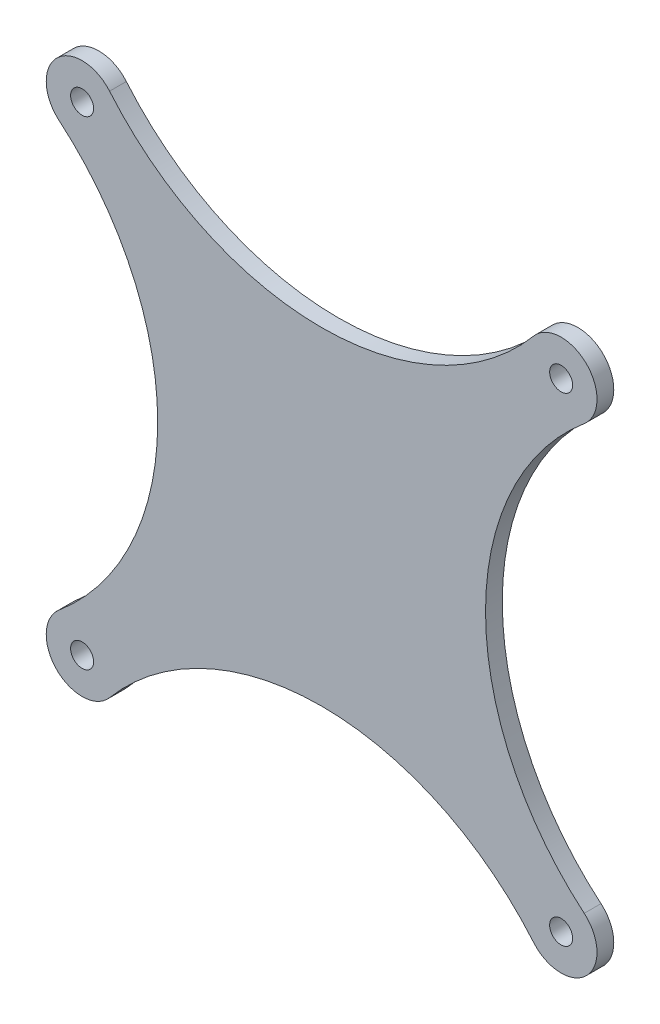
ISO-10303-21;
HEADER;
FILE_DESCRIPTION(('STEP AP214'),'2;1');
FILE_NAME('part.step','',(''),(''),'','','');
FILE_SCHEMA(('AUTOMOTIVE_DESIGN { 1 0 10303 214 1 1 1 1 }'));
ENDSEC;
DATA;
#1=APPLICATION_CONTEXT('core data for automotive mechanical design processes');
#2=APPLICATION_PROTOCOL_DEFINITION('international standard','automotive_design',2000,#1);
#3=PRODUCT_CONTEXT('',#1,'mechanical');
#4=PRODUCT('Part','Part','',(#3));
#5=PRODUCT_RELATED_PRODUCT_CATEGORY('part','',(#4));
#6=PRODUCT_DEFINITION_FORMATION('','',#4);
#7=PRODUCT_DEFINITION_CONTEXT('part definition',#1,'design');
#8=PRODUCT_DEFINITION('design','',#6,#7);
#9=PRODUCT_DEFINITION_SHAPE('','',#8);
#10=(LENGTH_UNIT() NAMED_UNIT(*) SI_UNIT(.MILLI.,.METRE.));
#11=(NAMED_UNIT(*) PLANE_ANGLE_UNIT() SI_UNIT($,.RADIAN.));
#12=(NAMED_UNIT(*) SI_UNIT($,.STERADIAN.) SOLID_ANGLE_UNIT());
#13=UNCERTAINTY_MEASURE_WITH_UNIT(LENGTH_MEASURE(1.E-05),#10,'distance_accuracy_value','');
#14=(GEOMETRIC_REPRESENTATION_CONTEXT(3) GLOBAL_UNCERTAINTY_ASSIGNED_CONTEXT((#13)) GLOBAL_UNIT_ASSIGNED_CONTEXT((#10,
#11,#12)) REPRESENTATION_CONTEXT('',''));
#15=CARTESIAN_POINT('',(0.,0.,0.));
#16=DIRECTION('',(0.,0.,1.));
#17=DIRECTION('',(1.,0.,0.));
#18=AXIS2_PLACEMENT_3D('',#15,#16,#17);
#19=CARTESIAN_POINT('',(0.,0.,0.));
#20=DIRECTION('',(0.,0.,1.));
#21=DIRECTION('',(1.,0.,0.));
#22=AXIS2_PLACEMENT_3D('',#19,#20,#21);
#23=PLANE('',#22);
#24=CARTESIAN_POINT('',(-50.0126,50.0126,0.));
#25=DIRECTION('',(0.,0.,1.));
#26=DIRECTION('',(1.,0.,0.));
#27=AXIS2_PLACEMENT_3D('',#24,#25,#26);
#28=CIRCLE('',#27,2.39999999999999);
#29=CARTESIAN_POINT('',(-47.6126,50.0126,0.));
#30=VERTEX_POINT('',#29);
#31=EDGE_CURVE('E234',#30,#30,#28,.T.);
#32=ORIENTED_EDGE('',*,*,#31,.F.);
#33=EDGE_LOOP('',(#32));
#34=FACE_BOUND('',#33,.T.);
#35=CARTESIAN_POINT('',(50.0126,50.0126,0.));
#36=DIRECTION('',(0.,0.,1.));
#37=DIRECTION('',(1.,0.,0.));
#38=AXIS2_PLACEMENT_3D('',#35,#36,#37);
#39=CIRCLE('',#38,2.39999999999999);
#40=CARTESIAN_POINT('',(52.4126,50.0126,0.));
#41=VERTEX_POINT('',#40);
#42=EDGE_CURVE('E229',#41,#41,#39,.T.);
#43=ORIENTED_EDGE('',*,*,#42,.F.);
#44=EDGE_LOOP('',(#43));
#45=FACE_BOUND('',#44,.T.);
#46=CARTESIAN_POINT('',(50.0126,-50.0126,0.));
#47=DIRECTION('',(0.,0.,1.));
#48=DIRECTION('',(1.,0.,0.));
#49=AXIS2_PLACEMENT_3D('',#46,#47,#48);
#50=CIRCLE('',#49,2.39999999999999);
#51=CARTESIAN_POINT('',(52.4126,-50.0126,0.));
#52=VERTEX_POINT('',#51);
#53=EDGE_CURVE('E223',#52,#52,#50,.T.);
#54=ORIENTED_EDGE('',*,*,#53,.F.);
#55=EDGE_LOOP('',(#54));
#56=FACE_BOUND('',#55,.T.);
#57=CARTESIAN_POINT('',(-50.0126,-50.0126,0.));
#58=DIRECTION('',(0.,0.,1.));
#59=DIRECTION('',(1.,0.,0.));
#60=AXIS2_PLACEMENT_3D('',#57,#58,#59);
#61=CIRCLE('',#60,2.39999999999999);
#62=CARTESIAN_POINT('',(-47.6126,-50.0126,0.));
#63=VERTEX_POINT('',#62);
#64=EDGE_CURVE('E217',#63,#63,#61,.T.);
#65=ORIENTED_EDGE('',*,*,#64,.F.);
#66=EDGE_LOOP('',(#65));
#67=FACE_BOUND('',#66,.T.);
#68=CARTESIAN_POINT('',(92.1004,0.,0.));
#69=DIRECTION('',(0.,0.,-1.));
#70=DIRECTION('',(-1.,0.,0.));
#71=AXIS2_PLACEMENT_3D('',#68,#69,#70);
#72=CIRCLE('',#71,57.8724577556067);
#73=CARTESIAN_POINT('',(54.8372259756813,-44.2795350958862,0.));
#74=VERTEX_POINT('',#73);
#75=CARTESIAN_POINT('',(54.8372259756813,44.2795350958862,0.));
#76=VERTEX_POINT('',#75);
#77=EDGE_CURVE('E123',#74,#76,#72,.T.);
#78=ORIENTED_EDGE('',*,*,#77,.T.);
#79=CARTESIAN_POINT('',(50.0126,50.0126,0.));
#80=DIRECTION('',(0.,0.,-1.));
#81=DIRECTION('',(-1.,0.,0.));
#82=AXIS2_PLACEMENT_3D('',#79,#80,#81);
#83=CIRCLE('',#82,7.493);
#84=CARTESIAN_POINT('',(44.2795350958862,54.8372259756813,0.));
#85=VERTEX_POINT('',#84);
#86=EDGE_CURVE('E120',#85,#76,#83,.T.);
#87=ORIENTED_EDGE('',*,*,#86,.F.);
#88=CARTESIAN_POINT('',(0.,92.1004,0.));
#89=DIRECTION('',(0.,0.,-1.));
#90=DIRECTION('',(-1.,0.,0.));
#91=AXIS2_PLACEMENT_3D('',#88,#89,#90);
#92=CIRCLE('',#91,57.8724577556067);
#93=CARTESIAN_POINT('',(-44.2795350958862,54.8372259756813,0.));
#94=VERTEX_POINT('',#93);
#95=EDGE_CURVE('E108',#85,#94,#92,.T.);
#96=ORIENTED_EDGE('',*,*,#95,.T.);
#97=CARTESIAN_POINT('',(-50.0126,50.0126,0.));
#98=DIRECTION('',(0.,0.,-1.));
#99=DIRECTION('',(-1.,0.,0.));
#100=AXIS2_PLACEMENT_3D('',#97,#98,#99);
#101=CIRCLE('',#100,7.493);
#102=CARTESIAN_POINT('',(-54.8372259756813,44.2795350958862,0.));
#103=VERTEX_POINT('',#102);
#104=EDGE_CURVE('E106',#103,#94,#101,.T.);
#105=ORIENTED_EDGE('',*,*,#104,.F.);
#106=CARTESIAN_POINT('',(-92.1004,0.,0.));
#107=DIRECTION('',(0.,0.,-1.));
#108=DIRECTION('',(-1.,0.,0.));
#109=AXIS2_PLACEMENT_3D('',#106,#107,#108);
#110=CIRCLE('',#109,57.8724577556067);
#111=CARTESIAN_POINT('',(-54.8372259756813,-44.2795350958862,0.));
#112=VERTEX_POINT('',#111);
#113=EDGE_CURVE('E37',#103,#112,#110,.T.);
#114=ORIENTED_EDGE('',*,*,#113,.T.);
#115=CARTESIAN_POINT('',(-50.0126,-50.0126,0.));
#116=DIRECTION('',(0.,0.,-1.));
#117=DIRECTION('',(-1.,0.,0.));
#118=AXIS2_PLACEMENT_3D('',#115,#116,#117);
#119=CIRCLE('',#118,7.493);
#120=CARTESIAN_POINT('',(-44.2795350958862,-54.8372259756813,0.));
#121=VERTEX_POINT('',#120);
#122=EDGE_CURVE('E103',#121,#112,#119,.T.);
#123=ORIENTED_EDGE('',*,*,#122,.F.);
#124=CARTESIAN_POINT('',(0.,-92.1004,0.));
#125=DIRECTION('',(0.,0.,-1.));
#126=DIRECTION('',(-1.,0.,0.));
#127=AXIS2_PLACEMENT_3D('',#124,#125,#126);
#128=CIRCLE('',#127,57.8724577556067);
#129=CARTESIAN_POINT('',(44.2795350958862,-54.8372259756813,0.));
#130=VERTEX_POINT('',#129);
#131=EDGE_CURVE('E129',#121,#130,#128,.T.);
#132=ORIENTED_EDGE('',*,*,#131,.T.);
#133=CARTESIAN_POINT('',(50.0126,-50.0126,0.));
#134=DIRECTION('',(0.,0.,-1.));
#135=DIRECTION('',(-1.,0.,0.));
#136=AXIS2_PLACEMENT_3D('',#133,#134,#135);
#137=CIRCLE('',#136,7.493);
#138=EDGE_CURVE('E126',#74,#130,#137,.T.);
#139=ORIENTED_EDGE('',*,*,#138,.F.);
#140=EDGE_LOOP('',(#78,#87,#96,#105,#114,#123,#132,#139));
#141=FACE_BOUND('',#140,.T.);
#142=ADVANCED_FACE('F34',(#34,#45,#56,#67,#141),#23,.T.);
#143=CARTESIAN_POINT('',(-92.1004,0.,0.));
#144=DIRECTION('',(0.,0.,-1.));
#145=DIRECTION('',(-1.,0.,0.));
#146=AXIS2_PLACEMENT_3D('',#143,#144,#145);
#147=CYLINDRICAL_SURFACE('',#146,57.8724577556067);
#148=DIRECTION('',(0.,0.,-1.));
#149=VECTOR('',#148,1.);
#150=CARTESIAN_POINT('',(-54.8372259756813,-44.2795350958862,0.));
#151=LINE('',#150,#149);
#152=CARTESIAN_POINT('',(-54.8372259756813,-44.2795350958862,-3.50012));
#153=VERTEX_POINT('',#152);
#154=EDGE_CURVE('E100',#112,#153,#151,.T.);
#155=ORIENTED_EDGE('',*,*,#154,.F.);
#156=ORIENTED_EDGE('',*,*,#113,.F.);
#157=DIRECTION('',(0.,0.,-1.));
#158=VECTOR('',#157,1.);
#159=CARTESIAN_POINT('',(-54.8372259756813,44.2795350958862,0.));
#160=LINE('',#159,#158);
#161=CARTESIAN_POINT('',(-54.8372259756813,44.2795350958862,-3.50012));
#162=VERTEX_POINT('',#161);
#163=EDGE_CURVE('E99',#162,#103,#160,.F.);
#164=ORIENTED_EDGE('',*,*,#163,.F.);
#165=CARTESIAN_POINT('',(-92.1004,0.,-3.50012));
#166=DIRECTION('',(0.,0.,-1.));
#167=DIRECTION('',(-1.,0.,0.));
#168=AXIS2_PLACEMENT_3D('',#165,#166,#167);
#169=CIRCLE('',#168,57.8724577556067);
#170=EDGE_CURVE('E113',#162,#153,#169,.T.);
#171=ORIENTED_EDGE('',*,*,#170,.T.);
#172=EDGE_LOOP('',(#155,#156,#164,#171));
#173=FACE_BOUND('',#172,.T.);
#174=ADVANCED_FACE('F97',(#173),#147,.F.);
#175=CARTESIAN_POINT('',(-50.0126,-50.0126,0.));
#176=DIRECTION('',(0.,0.,-1.));
#177=DIRECTION('',(-1.,0.,0.));
#178=AXIS2_PLACEMENT_3D('',#175,#176,#177);
#179=CYLINDRICAL_SURFACE('',#178,7.493);
#180=ORIENTED_EDGE('',*,*,#122,.T.);
#181=ORIENTED_EDGE('',*,*,#154,.T.);
#182=CARTESIAN_POINT('',(-50.0126,-50.0126,-3.50012));
#183=DIRECTION('',(0.,0.,-1.));
#184=DIRECTION('',(-1.,0.,0.));
#185=AXIS2_PLACEMENT_3D('',#182,#183,#184);
#186=CIRCLE('',#185,7.493);
#187=CARTESIAN_POINT('',(-44.2795350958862,-54.8372259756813,-3.50012));
#188=VERTEX_POINT('',#187);
#189=EDGE_CURVE('E154',#153,#188,#186,.F.);
#190=ORIENTED_EDGE('',*,*,#189,.T.);
#191=DIRECTION('',(0.,0.,-1.));
#192=VECTOR('',#191,1.);
#193=CARTESIAN_POINT('',(-44.2795350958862,-54.8372259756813,0.));
#194=LINE('',#193,#192);
#195=EDGE_CURVE('E131',#188,#121,#194,.F.);
#196=ORIENTED_EDGE('',*,*,#195,.T.);
#197=EDGE_LOOP('',(#180,#181,#190,#196));
#198=FACE_BOUND('',#197,.T.);
#199=ADVANCED_FACE('F165',(#198),#179,.T.);
#200=CARTESIAN_POINT('',(0.,-92.1004,0.));
#201=DIRECTION('',(0.,0.,-1.));
#202=DIRECTION('',(-1.,0.,0.));
#203=AXIS2_PLACEMENT_3D('',#200,#201,#202);
#204=CYLINDRICAL_SURFACE('',#203,57.8724577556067);
#205=DIRECTION('',(0.,0.,-1.));
#206=VECTOR('',#205,1.);
#207=CARTESIAN_POINT('',(44.2795350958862,-54.8372259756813,0.));
#208=LINE('',#207,#206);
#209=CARTESIAN_POINT('',(44.2795350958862,-54.8372259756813,-3.50012));
#210=VERTEX_POINT('',#209);
#211=EDGE_CURVE('E128',#130,#210,#208,.T.);
#212=ORIENTED_EDGE('',*,*,#211,.F.);
#213=ORIENTED_EDGE('',*,*,#131,.F.);
#214=ORIENTED_EDGE('',*,*,#195,.F.);
#215=CARTESIAN_POINT('',(0.,-92.1004,-3.50012));
#216=DIRECTION('',(0.,0.,-1.));
#217=DIRECTION('',(-1.,0.,0.));
#218=AXIS2_PLACEMENT_3D('',#215,#216,#217);
#219=CIRCLE('',#218,57.8724577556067);
#220=EDGE_CURVE('E152',#188,#210,#219,.T.);
#221=ORIENTED_EDGE('',*,*,#220,.T.);
#222=EDGE_LOOP('',(#212,#213,#214,#221));
#223=FACE_BOUND('',#222,.T.);
#224=ADVANCED_FACE('F163',(#223),#204,.F.);
#225=CARTESIAN_POINT('',(50.0126,-50.0126,0.));
#226=DIRECTION('',(0.,0.,-1.));
#227=DIRECTION('',(-1.,0.,0.));
#228=AXIS2_PLACEMENT_3D('',#225,#226,#227);
#229=CYLINDRICAL_SURFACE('',#228,7.493);
#230=ORIENTED_EDGE('',*,*,#138,.T.);
#231=ORIENTED_EDGE('',*,*,#211,.T.);
#232=CARTESIAN_POINT('',(50.0126,-50.0126,-3.50012));
#233=DIRECTION('',(0.,0.,-1.));
#234=DIRECTION('',(-1.,0.,0.));
#235=AXIS2_PLACEMENT_3D('',#232,#233,#234);
#236=CIRCLE('',#235,7.493);
#237=CARTESIAN_POINT('',(54.8372259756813,-44.2795350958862,-3.50012));
#238=VERTEX_POINT('',#237);
#239=EDGE_CURVE('E149',#210,#238,#236,.F.);
#240=ORIENTED_EDGE('',*,*,#239,.T.);
#241=DIRECTION('',(0.,0.,-1.));
#242=VECTOR('',#241,1.);
#243=CARTESIAN_POINT('',(54.8372259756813,-44.2795350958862,0.));
#244=LINE('',#243,#242);
#245=EDGE_CURVE('E125',#238,#74,#244,.F.);
#246=ORIENTED_EDGE('',*,*,#245,.T.);
#247=EDGE_LOOP('',(#230,#231,#240,#246));
#248=FACE_BOUND('',#247,.T.);
#249=ADVANCED_FACE('F172',(#248),#229,.T.);
#250=CARTESIAN_POINT('',(92.1004,0.,0.));
#251=DIRECTION('',(0.,0.,-1.));
#252=DIRECTION('',(-1.,0.,0.));
#253=AXIS2_PLACEMENT_3D('',#250,#251,#252);
#254=CYLINDRICAL_SURFACE('',#253,57.8724577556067);
#255=DIRECTION('',(0.,0.,-1.));
#256=VECTOR('',#255,1.);
#257=CARTESIAN_POINT('',(54.8372259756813,44.2795350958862,0.));
#258=LINE('',#257,#256);
#259=CARTESIAN_POINT('',(54.8372259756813,44.2795350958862,-3.50012));
#260=VERTEX_POINT('',#259);
#261=EDGE_CURVE('E122',#76,#260,#258,.T.);
#262=ORIENTED_EDGE('',*,*,#261,.F.);
#263=ORIENTED_EDGE('',*,*,#77,.F.);
#264=ORIENTED_EDGE('',*,*,#245,.F.);
#265=CARTESIAN_POINT('',(92.1004,0.,-3.50012));
#266=DIRECTION('',(0.,0.,-1.));
#267=DIRECTION('',(-1.,0.,0.));
#268=AXIS2_PLACEMENT_3D('',#265,#266,#267);
#269=CIRCLE('',#268,57.8724577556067);
#270=EDGE_CURVE('E146',#238,#260,#269,.T.);
#271=ORIENTED_EDGE('',*,*,#270,.T.);
#272=EDGE_LOOP('',(#262,#263,#264,#271));
#273=FACE_BOUND('',#272,.T.);
#274=ADVANCED_FACE('F197',(#273),#254,.F.);
#275=CARTESIAN_POINT('',(50.0126,50.0126,0.));
#276=DIRECTION('',(0.,0.,-1.));
#277=DIRECTION('',(-1.,0.,0.));
#278=AXIS2_PLACEMENT_3D('',#275,#276,#277);
#279=CYLINDRICAL_SURFACE('',#278,7.493);
#280=ORIENTED_EDGE('',*,*,#86,.T.);
#281=ORIENTED_EDGE('',*,*,#261,.T.);
#282=CARTESIAN_POINT('',(50.0126,50.0126,-3.50012));
#283=DIRECTION('',(0.,0.,-1.));
#284=DIRECTION('',(-1.,0.,0.));
#285=AXIS2_PLACEMENT_3D('',#282,#283,#284);
#286=CIRCLE('',#285,7.493);
#287=CARTESIAN_POINT('',(44.2795350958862,54.8372259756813,-3.50012));
#288=VERTEX_POINT('',#287);
#289=EDGE_CURVE('E143',#260,#288,#286,.F.);
#290=ORIENTED_EDGE('',*,*,#289,.T.);
#291=DIRECTION('',(0.,0.,-1.));
#292=VECTOR('',#291,1.);
#293=CARTESIAN_POINT('',(44.2795350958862,54.8372259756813,0.));
#294=LINE('',#293,#292);
#295=EDGE_CURVE('E119',#288,#85,#294,.F.);
#296=ORIENTED_EDGE('',*,*,#295,.T.);
#297=EDGE_LOOP('',(#280,#281,#290,#296));
#298=FACE_BOUND('',#297,.T.);
#299=ADVANCED_FACE('F193',(#298),#279,.T.);
#300=CARTESIAN_POINT('',(0.,92.1004,0.));
#301=DIRECTION('',(0.,0.,-1.));
#302=DIRECTION('',(-1.,0.,0.));
#303=AXIS2_PLACEMENT_3D('',#300,#301,#302);
#304=CYLINDRICAL_SURFACE('',#303,57.8724577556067);
#305=DIRECTION('',(0.,0.,-1.));
#306=VECTOR('',#305,1.);
#307=CARTESIAN_POINT('',(-44.2795350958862,54.8372259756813,0.));
#308=LINE('',#307,#306);
#309=CARTESIAN_POINT('',(-44.2795350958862,54.8372259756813,-3.50012));
#310=VERTEX_POINT('',#309);
#311=EDGE_CURVE('E51',#94,#310,#308,.T.);
#312=ORIENTED_EDGE('',*,*,#311,.F.);
#313=ORIENTED_EDGE('',*,*,#95,.F.);
#314=ORIENTED_EDGE('',*,*,#295,.F.);
#315=CARTESIAN_POINT('',(0.,92.1004,-3.50012));
#316=DIRECTION('',(0.,0.,-1.));
#317=DIRECTION('',(-1.,0.,0.));
#318=AXIS2_PLACEMENT_3D('',#315,#316,#317);
#319=CIRCLE('',#318,57.8724577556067);
#320=EDGE_CURVE('E43',#288,#310,#319,.T.);
#321=ORIENTED_EDGE('',*,*,#320,.T.);
#322=EDGE_LOOP('',(#312,#313,#314,#321));
#323=FACE_BOUND('',#322,.T.);
#324=ADVANCED_FACE('F185',(#323),#304,.F.);
#325=CARTESIAN_POINT('',(-50.0126,50.0126,0.));
#326=DIRECTION('',(0.,0.,-1.));
#327=DIRECTION('',(-1.,0.,0.));
#328=AXIS2_PLACEMENT_3D('',#325,#326,#327);
#329=CYLINDRICAL_SURFACE('',#328,7.493);
#330=ORIENTED_EDGE('',*,*,#104,.T.);
#331=ORIENTED_EDGE('',*,*,#311,.T.);
#332=CARTESIAN_POINT('',(-50.0126,50.0126,-3.50012));
#333=DIRECTION('',(0.,0.,-1.));
#334=DIRECTION('',(-1.,0.,0.));
#335=AXIS2_PLACEMENT_3D('',#332,#333,#334);
#336=CIRCLE('',#335,7.493);
#337=EDGE_CURVE('E11',#310,#162,#336,.F.);
#338=ORIENTED_EDGE('',*,*,#337,.T.);
#339=ORIENTED_EDGE('',*,*,#163,.T.);
#340=EDGE_LOOP('',(#330,#331,#338,#339));
#341=FACE_BOUND('',#340,.T.);
#342=ADVANCED_FACE('F105',(#341),#329,.T.);
#343=CARTESIAN_POINT('',(0.,0.,-3.50012));
#344=DIRECTION('',(0.,0.,1.));
#345=DIRECTION('',(1.,0.,0.));
#346=AXIS2_PLACEMENT_3D('',#343,#344,#345);
#347=PLANE('',#346);
#348=CARTESIAN_POINT('',(-50.0126,50.0126,-3.50012));
#349=DIRECTION('',(0.,0.,1.));
#350=DIRECTION('',(1.,0.,0.));
#351=AXIS2_PLACEMENT_3D('',#348,#349,#350);
#352=CIRCLE('',#351,2.39999999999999);
#353=CARTESIAN_POINT('',(-47.6126,50.0126,-3.50012));
#354=VERTEX_POINT('',#353);
#355=EDGE_CURVE('E232',#354,#354,#352,.T.);
#356=ORIENTED_EDGE('',*,*,#355,.T.);
#357=EDGE_LOOP('',(#356));
#358=FACE_BOUND('',#357,.T.);
#359=CARTESIAN_POINT('',(50.0126,50.0126,-3.50012));
#360=DIRECTION('',(0.,0.,1.));
#361=DIRECTION('',(1.,0.,0.));
#362=AXIS2_PLACEMENT_3D('',#359,#360,#361);
#363=CIRCLE('',#362,2.39999999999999);
#364=CARTESIAN_POINT('',(52.4126,50.0126,-3.50012));
#365=VERTEX_POINT('',#364);
#366=EDGE_CURVE('E226',#365,#365,#363,.T.);
#367=ORIENTED_EDGE('',*,*,#366,.T.);
#368=EDGE_LOOP('',(#367));
#369=FACE_BOUND('',#368,.T.);
#370=CARTESIAN_POINT('',(50.0126,-50.0126,-3.50012));
#371=DIRECTION('',(0.,0.,1.));
#372=DIRECTION('',(1.,0.,0.));
#373=AXIS2_PLACEMENT_3D('',#370,#371,#372);
#374=CIRCLE('',#373,2.39999999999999);
#375=CARTESIAN_POINT('',(52.4126,-50.0126,-3.50012));
#376=VERTEX_POINT('',#375);
#377=EDGE_CURVE('E220',#376,#376,#374,.T.);
#378=ORIENTED_EDGE('',*,*,#377,.T.);
#379=EDGE_LOOP('',(#378));
#380=FACE_BOUND('',#379,.T.);
#381=CARTESIAN_POINT('',(-50.0126,-50.0126,-3.50012));
#382=DIRECTION('',(0.,0.,1.));
#383=DIRECTION('',(1.,0.,0.));
#384=AXIS2_PLACEMENT_3D('',#381,#382,#383);
#385=CIRCLE('',#384,2.39999999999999);
#386=CARTESIAN_POINT('',(-47.6126,-50.0126,-3.50012));
#387=VERTEX_POINT('',#386);
#388=EDGE_CURVE('E104',#387,#387,#385,.T.);
#389=ORIENTED_EDGE('',*,*,#388,.T.);
#390=EDGE_LOOP('',(#389));
#391=FACE_BOUND('',#390,.T.);
#392=ORIENTED_EDGE('',*,*,#320,.F.);
#393=ORIENTED_EDGE('',*,*,#289,.F.);
#394=ORIENTED_EDGE('',*,*,#270,.F.);
#395=ORIENTED_EDGE('',*,*,#239,.F.);
#396=ORIENTED_EDGE('',*,*,#220,.F.);
#397=ORIENTED_EDGE('',*,*,#189,.F.);
#398=ORIENTED_EDGE('',*,*,#170,.F.);
#399=ORIENTED_EDGE('',*,*,#337,.F.);
#400=EDGE_LOOP('',(#392,#393,#394,#395,#396,#397,#398,#399));
#401=FACE_BOUND('',#400,.T.);
#402=ADVANCED_FACE('F157',(#358,#369,#380,#391,#401),#347,.F.);
#403=CARTESIAN_POINT('',(-50.0126,-50.0126,0.));
#404=DIRECTION('',(0.,0.,1.));
#405=DIRECTION('',(1.,0.,0.));
#406=AXIS2_PLACEMENT_3D('',#403,#404,#405);
#407=CYLINDRICAL_SURFACE('',#406,2.39999999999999);
#408=ORIENTED_EDGE('',*,*,#388,.F.);
#409=EDGE_LOOP('',(#408));
#410=FACE_BOUND('',#409,.T.);
#411=ORIENTED_EDGE('',*,*,#64,.T.);
#412=EDGE_LOOP('',(#411));
#413=FACE_BOUND('',#412,.T.);
#414=ADVANCED_FACE('F175',(#410,#413),#407,.F.);
#415=CARTESIAN_POINT('',(50.0126,-50.0126,0.));
#416=DIRECTION('',(0.,0.,1.));
#417=DIRECTION('',(1.,0.,0.));
#418=AXIS2_PLACEMENT_3D('',#415,#416,#417);
#419=CYLINDRICAL_SURFACE('',#418,2.39999999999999);
#420=ORIENTED_EDGE('',*,*,#377,.F.);
#421=EDGE_LOOP('',(#420));
#422=FACE_BOUND('',#421,.T.);
#423=ORIENTED_EDGE('',*,*,#53,.T.);
#424=EDGE_LOOP('',(#423));
#425=FACE_BOUND('',#424,.T.);
#426=ADVANCED_FACE('F182',(#422,#425),#419,.F.);
#427=CARTESIAN_POINT('',(50.0126,50.0126,0.));
#428=DIRECTION('',(0.,0.,1.));
#429=DIRECTION('',(1.,0.,0.));
#430=AXIS2_PLACEMENT_3D('',#427,#428,#429);
#431=CYLINDRICAL_SURFACE('',#430,2.39999999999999);
#432=ORIENTED_EDGE('',*,*,#366,.F.);
#433=EDGE_LOOP('',(#432));
#434=FACE_BOUND('',#433,.T.);
#435=ORIENTED_EDGE('',*,*,#42,.T.);
#436=EDGE_LOOP('',(#435));
#437=FACE_BOUND('',#436,.T.);
#438=ADVANCED_FACE('F250',(#434,#437),#431,.F.);
#439=CARTESIAN_POINT('',(-50.0126,50.0126,0.));
#440=DIRECTION('',(0.,0.,1.));
#441=DIRECTION('',(1.,0.,0.));
#442=AXIS2_PLACEMENT_3D('',#439,#440,#441);
#443=CYLINDRICAL_SURFACE('',#442,2.39999999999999);
#444=ORIENTED_EDGE('',*,*,#355,.F.);
#445=EDGE_LOOP('',(#444));
#446=FACE_BOUND('',#445,.T.);
#447=ORIENTED_EDGE('',*,*,#31,.T.);
#448=EDGE_LOOP('',(#447));
#449=FACE_BOUND('',#448,.T.);
#450=ADVANCED_FACE('F238',(#446,#449),#443,.F.);
#451=CLOSED_SHELL('',(#142,#174,#199,#224,#249,#274,#299,#324,#342,#402,#414,#426,#438,#450));
#452=MANIFOLD_SOLID_BREP('B2',#451);
#453=ADVANCED_BREP_SHAPE_REPRESENTATION('',(#18,#452),#14);
#454=SHAPE_DEFINITION_REPRESENTATION(#9,#453);
ENDSEC;
END-ISO-10303-21;
